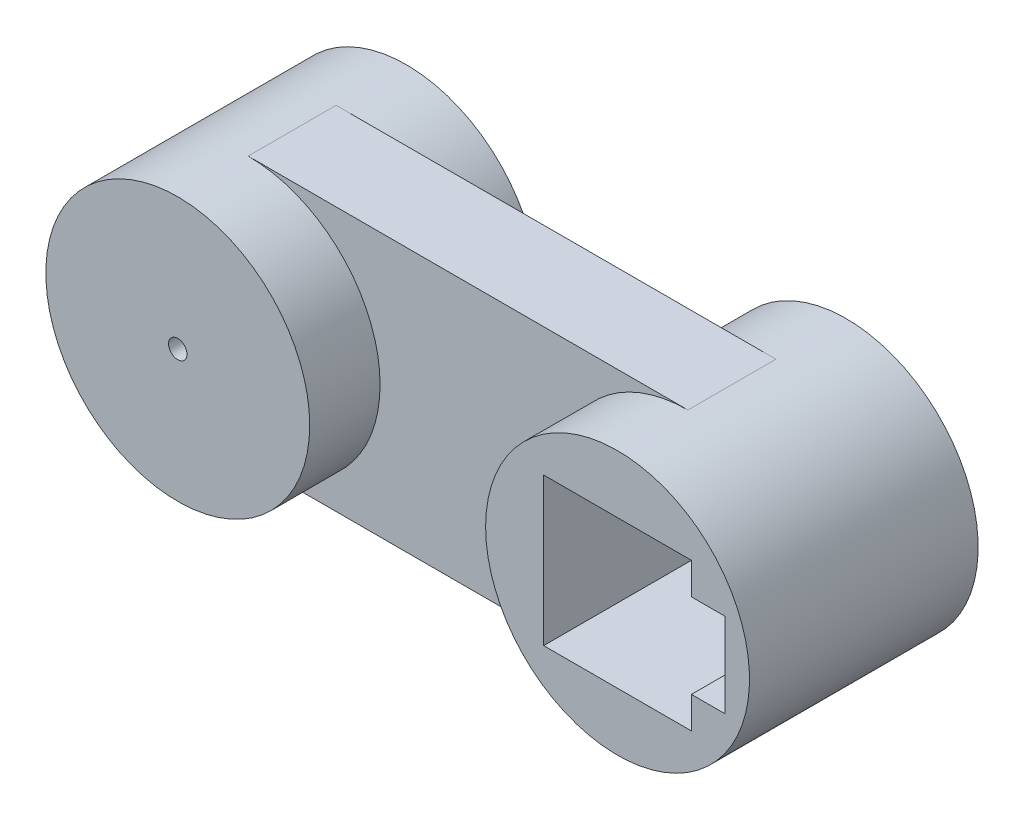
from build123d import *

# Parameters (mm, degrees)
SKETCH1_R           = 38.1
BOSS_EXTRUDE1_DEPTH = 33.02
CUT_EXTRUDE1_DEPTH  = 25.4
SKETCH3_R           = 2.667
CUT_EXTRUDE2_DEPTH  = 5.588
BOSS_EXTRUDE2_DEPTH = 12.7
SKETCH5_W           = 42.672
SKETCH5_H           = 42.672
SKETCH5_W_2         = 9.652
SKETCH5_H_2         = 24.384
CUT_EXTRUDE3_DEPTH  = 59.944


with BuildPart() as part:
    # Sketch1 → Boss-Extrude1 (new, symmetric)
    with BuildSketch(Plane.XY):
        Circle(SKETCH1_R)
    boss_extrude1 = extrude(amount=BOSS_EXTRUDE1_DEPTH, both=True)

    # Sketch2 → Cut-Extrude1 (cut)
    with BuildSketch(Plane.XY.offset(33.02)):
        with BuildLine():
            Line((1.866511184, 1.905), (-1.866511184, 1.905))
            ThreePointArc((-1.866511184, 1.905), (-1.033175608, -2.458747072), (2.667, 0))
            ThreePointArc((2.667, 0), (2.458747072, 1.033175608), (1.866511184, 1.905))
        make_face()
    extrude(amount=-CUT_EXTRUDE1_DEPTH, mode=Mode.SUBTRACT)

    # Sketch3 → Cut-Extrude2 (cut)
    with BuildSketch(Plane.XY.offset(33.02)):
        Circle(SKETCH3_R)
    extrude(amount=-CUT_EXTRUDE2_DEPTH, mode=Mode.SUBTRACT)

    # Sketch4 → Boss-Extrude2 (add, symmetric)
    with BuildSketch(Plane.XY):
        with BuildLine():
            Line((127, 38.1), (0, 38.1))
            ThreePointArc((0, 38.1), (26.940768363, 26.940768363), (38.1, 0))
            ThreePointArc((38.1, 0), (26.940768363, -26.940768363), (0, -38.1))
            Line((0, -38.1), (127, -38.1))
            ThreePointArc((127, -38.1), (88.9, 0), (127, 38.1))
        make_face()
    extrude(amount=BOSS_EXTRUDE2_DEPTH, both=True)

    # Mirror2: Boss-Extrude1 across plane
    add(boss_extrude1.mirror(Plane(origin=(63.5, 0, 0), x_dir=(0, 0, 1), z_dir=(1, 0, 0))))

    # Sketch5 → Cut-Extrude3 (cut)
    with BuildSketch(Plane.XY.offset(33.02)):
        with Locations((127, 0)):
            Rectangle(SKETCH5_W, SKETCH5_H)
        with Locations((153.162, 0)):
            Rectangle(SKETCH5_W_2, SKETCH5_H_2)
    extrude(amount=-CUT_EXTRUDE3_DEPTH, mode=Mode.SUBTRACT)


solid = part.part
